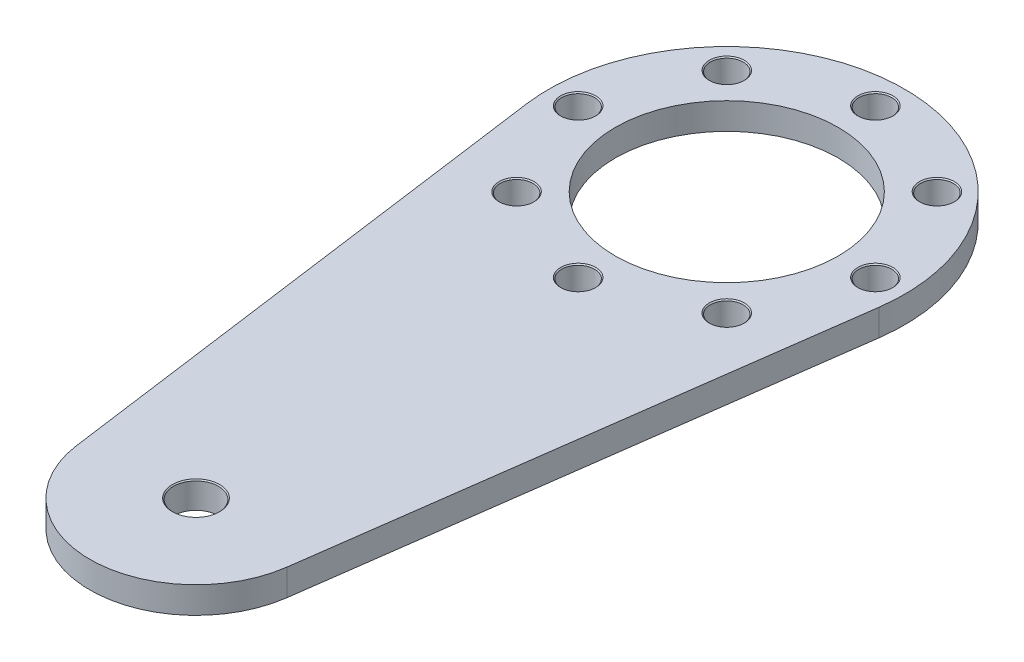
ISO-10303-21;
HEADER;
FILE_DESCRIPTION(('STEP AP214'),'2;1');
FILE_NAME('part.step','',(''),(''),'','','');
FILE_SCHEMA(('AUTOMOTIVE_DESIGN { 1 0 10303 214 1 1 1 1 }'));
ENDSEC;
DATA;
#1=APPLICATION_CONTEXT('core data for automotive mechanical design processes');
#2=APPLICATION_PROTOCOL_DEFINITION('international standard','automotive_design',2000,#1);
#3=PRODUCT_CONTEXT('',#1,'mechanical');
#4=PRODUCT('Part','Part','',(#3));
#5=PRODUCT_RELATED_PRODUCT_CATEGORY('part','',(#4));
#6=PRODUCT_DEFINITION_FORMATION('','',#4);
#7=PRODUCT_DEFINITION_CONTEXT('part definition',#1,'design');
#8=PRODUCT_DEFINITION('design','',#6,#7);
#9=PRODUCT_DEFINITION_SHAPE('','',#8);
#10=(LENGTH_UNIT() NAMED_UNIT(*) SI_UNIT(.MILLI.,.METRE.));
#11=(NAMED_UNIT(*) PLANE_ANGLE_UNIT() SI_UNIT($,.RADIAN.));
#12=(NAMED_UNIT(*) SI_UNIT($,.STERADIAN.) SOLID_ANGLE_UNIT());
#13=UNCERTAINTY_MEASURE_WITH_UNIT(LENGTH_MEASURE(1.E-05),#10,'distance_accuracy_value','');
#14=(GEOMETRIC_REPRESENTATION_CONTEXT(3) GLOBAL_UNCERTAINTY_ASSIGNED_CONTEXT((#13)) GLOBAL_UNIT_ASSIGNED_CONTEXT((#10,
#11,#12)) REPRESENTATION_CONTEXT('',''));
#15=CARTESIAN_POINT('',(0.,0.,0.));
#16=DIRECTION('',(0.,0.,1.));
#17=DIRECTION('',(1.,0.,0.));
#18=AXIS2_PLACEMENT_3D('',#15,#16,#17);
#19=CARTESIAN_POINT('',(0.,5.,0.));
#20=DIRECTION('',(0.,1.,0.));
#21=DIRECTION('',(0.,0.,1.));
#22=AXIS2_PLACEMENT_3D('',#19,#20,#21);
#23=PLANE('',#22);
#24=CARTESIAN_POINT('',(-19.7989898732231,5.,19.7989898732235));
#25=DIRECTION('',(0.,1.,0.));
#26=DIRECTION('',(0.,0.,1.));
#27=AXIS2_PLACEMENT_3D('',#24,#25,#26);
#28=CIRCLE('',#27,3.3);
#29=CARTESIAN_POINT('',(-19.7989898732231,5.,23.0989898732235));
#30=VERTEX_POINT('',#29);
#31=EDGE_CURVE('E515',#30,#30,#28,.T.);
#32=ORIENTED_EDGE('',*,*,#31,.F.);
#33=EDGE_LOOP('',(#32));
#34=FACE_BOUND('',#33,.T.);
#35=CARTESIAN_POINT('',(-28.,5.,2.18677445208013E-13));
#36=DIRECTION('',(0.,1.,0.));
#37=DIRECTION('',(0.,0.,1.));
#38=AXIS2_PLACEMENT_3D('',#35,#36,#37);
#39=CIRCLE('',#38,3.3);
#40=CARTESIAN_POINT('',(-28.,5.,3.30000000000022));
#41=VERTEX_POINT('',#40);
#42=EDGE_CURVE('E185',#41,#41,#39,.T.);
#43=ORIENTED_EDGE('',*,*,#42,.F.);
#44=EDGE_LOOP('',(#43));
#45=FACE_BOUND('',#44,.T.);
#46=CARTESIAN_POINT('',(-19.7989898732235,5.,-19.7989898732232));
#47=DIRECTION('',(0.,1.,0.));
#48=DIRECTION('',(0.,0.,1.));
#49=AXIS2_PLACEMENT_3D('',#46,#47,#48);
#50=CIRCLE('',#49,3.3);
#51=CARTESIAN_POINT('',(-19.7989898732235,5.,-16.4989898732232));
#52=VERTEX_POINT('',#51);
#53=EDGE_CURVE('E175',#52,#52,#50,.T.);
#54=ORIENTED_EDGE('',*,*,#53,.F.);
#55=EDGE_LOOP('',(#54));
#56=FACE_BOUND('',#55,.T.);
#57=CARTESIAN_POINT('',(-1.45784963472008E-13,5.,-28.));
#58=DIRECTION('',(0.,1.,0.));
#59=DIRECTION('',(0.,0.,1.));
#60=AXIS2_PLACEMENT_3D('',#57,#58,#59);
#61=CIRCLE('',#60,3.3);
#62=CARTESIAN_POINT('',(-1.45784963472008E-13,5.,-24.7));
#63=VERTEX_POINT('',#62);
#64=EDGE_CURVE('E170',#63,#63,#61,.T.);
#65=ORIENTED_EDGE('',*,*,#64,.F.);
#66=EDGE_LOOP('',(#65));
#67=FACE_BOUND('',#66,.T.);
#68=CARTESIAN_POINT('',(19.7989898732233,5.,-19.7989898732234));
#69=DIRECTION('',(0.,1.,0.));
#70=DIRECTION('',(0.,0.,1.));
#71=AXIS2_PLACEMENT_3D('',#68,#69,#70);
#72=CIRCLE('',#71,3.3);
#73=CARTESIAN_POINT('',(19.7989898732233,5.,-16.4989898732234));
#74=VERTEX_POINT('',#73);
#75=EDGE_CURVE('E165',#74,#74,#72,.T.);
#76=ORIENTED_EDGE('',*,*,#75,.F.);
#77=EDGE_LOOP('',(#76));
#78=FACE_BOUND('',#77,.T.);
#79=CARTESIAN_POINT('',(28.,5.,0.));
#80=DIRECTION('',(0.,1.,0.));
#81=DIRECTION('',(0.,0.,1.));
#82=AXIS2_PLACEMENT_3D('',#79,#80,#81);
#83=CIRCLE('',#82,3.3);
#84=CARTESIAN_POINT('',(28.,5.,3.29999999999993));
#85=VERTEX_POINT('',#84);
#86=EDGE_CURVE('E159',#85,#85,#83,.T.);
#87=ORIENTED_EDGE('',*,*,#86,.F.);
#88=EDGE_LOOP('',(#87));
#89=FACE_BOUND('',#88,.T.);
#90=CARTESIAN_POINT('',(19.7989898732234,5.,19.7989898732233));
#91=DIRECTION('',(0.,1.,0.));
#92=DIRECTION('',(0.,0.,1.));
#93=AXIS2_PLACEMENT_3D('',#90,#91,#92);
#94=CIRCLE('',#93,3.3);
#95=CARTESIAN_POINT('',(19.7989898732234,5.,23.0989898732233));
#96=VERTEX_POINT('',#95);
#97=EDGE_CURVE('E153',#96,#96,#94,.T.);
#98=ORIENTED_EDGE('',*,*,#97,.F.);
#99=EDGE_LOOP('',(#98));
#100=FACE_BOUND('',#99,.T.);
#101=CARTESIAN_POINT('',(0.,5.,28.));
#102=DIRECTION('',(0.,1.,0.));
#103=DIRECTION('',(0.,0.,1.));
#104=AXIS2_PLACEMENT_3D('',#101,#102,#103);
#105=CIRCLE('',#104,3.3);
#106=CARTESIAN_POINT('',(0.,5.,31.3));
#107=VERTEX_POINT('',#106);
#108=EDGE_CURVE('E147',#107,#107,#105,.T.);
#109=ORIENTED_EDGE('',*,*,#108,.F.);
#110=EDGE_LOOP('',(#109));
#111=FACE_BOUND('',#110,.T.);
#112=CARTESIAN_POINT('',(0.,5.,100.));
#113=DIRECTION('',(0.,1.,0.));
#114=DIRECTION('',(0.,0.,1.));
#115=AXIS2_PLACEMENT_3D('',#112,#113,#114);
#116=CIRCLE('',#115,4.45);
#117=CARTESIAN_POINT('',(0.,5.,104.45));
#118=VERTEX_POINT('',#117);
#119=EDGE_CURVE('E141',#118,#118,#116,.T.);
#120=ORIENTED_EDGE('',*,*,#119,.F.);
#121=EDGE_LOOP('',(#120));
#122=FACE_BOUND('',#121,.T.);
#123=CARTESIAN_POINT('',(0.,5.,0.));
#124=DIRECTION('',(0.,1.,0.));
#125=DIRECTION('',(0.,0.,1.));
#126=AXIS2_PLACEMENT_3D('',#123,#124,#125);
#127=CIRCLE('',#126,33.5);
#128=CARTESIAN_POINT('',(33.1933275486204,5.,4.52249999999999));
#129=VERTEX_POINT('',#128);
#130=CARTESIAN_POINT('',(-33.1933275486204,5.,4.52249999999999));
#131=VERTEX_POINT('',#130);
#132=EDGE_CURVE('E98',#129,#131,#127,.T.);
#133=ORIENTED_EDGE('',*,*,#132,.T.);
#134=DIRECTION('',(0.135,0.,0.99084559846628));
#135=VECTOR('',#134,1.);
#136=CARTESIAN_POINT('',(-33.1933275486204,5.,4.52249999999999));
#137=LINE('',#136,#135);
#138=CARTESIAN_POINT('',(-19.8169119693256,5.,102.7));
#139=VERTEX_POINT('',#138);
#140=EDGE_CURVE('E93',#131,#139,#137,.T.);
#141=ORIENTED_EDGE('',*,*,#140,.T.);
#142=CARTESIAN_POINT('',(0.,5.,100.));
#143=DIRECTION('',(0.,1.,0.));
#144=DIRECTION('',(0.,0.,1.));
#145=AXIS2_PLACEMENT_3D('',#142,#143,#144);
#146=CIRCLE('',#145,20.);
#147=CARTESIAN_POINT('',(19.8169119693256,5.,102.7));
#148=VERTEX_POINT('',#147);
#149=EDGE_CURVE('E96',#139,#148,#146,.T.);
#150=ORIENTED_EDGE('',*,*,#149,.T.);
#151=DIRECTION('',(0.135,0.,-0.99084559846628));
#152=VECTOR('',#151,1.);
#153=CARTESIAN_POINT('',(33.1933275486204,5.,4.52249999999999));
#154=LINE('',#153,#152);
#155=EDGE_CURVE('E63',#148,#129,#154,.T.);
#156=ORIENTED_EDGE('',*,*,#155,.T.);
#157=EDGE_LOOP('',(#133,#141,#150,#156));
#158=FACE_BOUND('',#157,.T.);
#159=CARTESIAN_POINT('',(0.,5.,0.));
#160=DIRECTION('',(0.,1.,0.));
#161=DIRECTION('',(0.,0.,1.));
#162=AXIS2_PLACEMENT_3D('',#159,#160,#161);
#163=CIRCLE('',#162,21.);
#164=CARTESIAN_POINT('',(0.,5.,21.));
#165=VERTEX_POINT('',#164);
#166=EDGE_CURVE('E120',#165,#165,#163,.T.);
#167=ORIENTED_EDGE('',*,*,#166,.F.);
#168=EDGE_LOOP('',(#167));
#169=FACE_BOUND('',#168,.T.);
#170=ADVANCED_FACE('F43',(#34,#45,#56,#67,#78,#89,#100,#111,#122,#158,#169),#23,.T.);
#171=CARTESIAN_POINT('',(0.,0.,0.));
#172=DIRECTION('',(0.,1.,0.));
#173=DIRECTION('',(0.,0.,1.));
#174=AXIS2_PLACEMENT_3D('',#171,#172,#173);
#175=PLANE('',#174);
#176=CARTESIAN_POINT('',(-19.7989898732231,0.,19.7989898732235));
#177=DIRECTION('',(0.,1.,0.));
#178=DIRECTION('',(0.,0.,1.));
#179=AXIS2_PLACEMENT_3D('',#176,#177,#178);
#180=CIRCLE('',#179,3.1);
#181=CARTESIAN_POINT('',(-19.7989898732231,0.,22.8989898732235));
#182=VERTEX_POINT('',#181);
#183=EDGE_CURVE('E47',#182,#182,#180,.T.);
#184=ORIENTED_EDGE('',*,*,#183,.T.);
#185=EDGE_LOOP('',(#184));
#186=FACE_BOUND('',#185,.T.);
#187=CARTESIAN_POINT('',(-28.,0.,2.18677445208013E-13));
#188=DIRECTION('',(0.,1.,0.));
#189=DIRECTION('',(0.,0.,1.));
#190=AXIS2_PLACEMENT_3D('',#187,#188,#189);
#191=CIRCLE('',#190,3.1);
#192=CARTESIAN_POINT('',(-28.,0.,3.10000000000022));
#193=VERTEX_POINT('',#192);
#194=EDGE_CURVE('E172',#193,#193,#191,.T.);
#195=ORIENTED_EDGE('',*,*,#194,.T.);
#196=EDGE_LOOP('',(#195));
#197=FACE_BOUND('',#196,.T.);
#198=CARTESIAN_POINT('',(-19.7989898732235,0.,-19.7989898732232));
#199=DIRECTION('',(0.,1.,0.));
#200=DIRECTION('',(0.,0.,1.));
#201=AXIS2_PLACEMENT_3D('',#198,#199,#200);
#202=CIRCLE('',#201,3.1);
#203=CARTESIAN_POINT('',(-19.7989898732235,0.,-16.6989898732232));
#204=VERTEX_POINT('',#203);
#205=EDGE_CURVE('E167',#204,#204,#202,.T.);
#206=ORIENTED_EDGE('',*,*,#205,.T.);
#207=EDGE_LOOP('',(#206));
#208=FACE_BOUND('',#207,.T.);
#209=CARTESIAN_POINT('',(-1.45784963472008E-13,0.,-28.));
#210=DIRECTION('',(0.,1.,0.));
#211=DIRECTION('',(0.,0.,1.));
#212=AXIS2_PLACEMENT_3D('',#209,#210,#211);
#213=CIRCLE('',#212,3.1);
#214=CARTESIAN_POINT('',(-1.45784963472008E-13,0.,-24.9));
#215=VERTEX_POINT('',#214);
#216=EDGE_CURVE('E161',#215,#215,#213,.T.);
#217=ORIENTED_EDGE('',*,*,#216,.T.);
#218=EDGE_LOOP('',(#217));
#219=FACE_BOUND('',#218,.T.);
#220=CARTESIAN_POINT('',(19.7989898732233,0.,-19.7989898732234));
#221=DIRECTION('',(0.,1.,0.));
#222=DIRECTION('',(0.,0.,1.));
#223=AXIS2_PLACEMENT_3D('',#220,#221,#222);
#224=CIRCLE('',#223,3.1);
#225=CARTESIAN_POINT('',(19.7989898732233,0.,-16.6989898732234));
#226=VERTEX_POINT('',#225);
#227=EDGE_CURVE('E155',#226,#226,#224,.T.);
#228=ORIENTED_EDGE('',*,*,#227,.T.);
#229=EDGE_LOOP('',(#228));
#230=FACE_BOUND('',#229,.T.);
#231=CARTESIAN_POINT('',(28.,0.,0.));
#232=DIRECTION('',(0.,1.,0.));
#233=DIRECTION('',(0.,0.,1.));
#234=AXIS2_PLACEMENT_3D('',#231,#232,#233);
#235=CIRCLE('',#234,3.1);
#236=CARTESIAN_POINT('',(28.,0.,3.09999999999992));
#237=VERTEX_POINT('',#236);
#238=EDGE_CURVE('E149',#237,#237,#235,.T.);
#239=ORIENTED_EDGE('',*,*,#238,.T.);
#240=EDGE_LOOP('',(#239));
#241=FACE_BOUND('',#240,.T.);
#242=CARTESIAN_POINT('',(19.7989898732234,0.,19.7989898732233));
#243=DIRECTION('',(0.,1.,0.));
#244=DIRECTION('',(0.,0.,1.));
#245=AXIS2_PLACEMENT_3D('',#242,#243,#244);
#246=CIRCLE('',#245,3.1);
#247=CARTESIAN_POINT('',(19.7989898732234,0.,22.8989898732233));
#248=VERTEX_POINT('',#247);
#249=EDGE_CURVE('E143',#248,#248,#246,.T.);
#250=ORIENTED_EDGE('',*,*,#249,.T.);
#251=EDGE_LOOP('',(#250));
#252=FACE_BOUND('',#251,.T.);
#253=CARTESIAN_POINT('',(0.,0.,28.));
#254=DIRECTION('',(0.,1.,0.));
#255=DIRECTION('',(0.,0.,1.));
#256=AXIS2_PLACEMENT_3D('',#253,#254,#255);
#257=CIRCLE('',#256,3.1);
#258=CARTESIAN_POINT('',(0.,0.,31.1));
#259=VERTEX_POINT('',#258);
#260=EDGE_CURVE('E137',#259,#259,#257,.T.);
#261=ORIENTED_EDGE('',*,*,#260,.T.);
#262=EDGE_LOOP('',(#261));
#263=FACE_BOUND('',#262,.T.);
#264=CARTESIAN_POINT('',(0.,0.,100.));
#265=DIRECTION('',(0.,1.,0.));
#266=DIRECTION('',(0.,0.,1.));
#267=AXIS2_PLACEMENT_3D('',#264,#265,#266);
#268=CIRCLE('',#267,4.25);
#269=CARTESIAN_POINT('',(0.,0.,104.25));
#270=VERTEX_POINT('',#269);
#271=EDGE_CURVE('E131',#270,#270,#268,.T.);
#272=ORIENTED_EDGE('',*,*,#271,.T.);
#273=EDGE_LOOP('',(#272));
#274=FACE_BOUND('',#273,.T.);
#275=CARTESIAN_POINT('',(0.,0.,0.));
#276=DIRECTION('',(0.,1.,0.));
#277=DIRECTION('',(0.,0.,1.));
#278=AXIS2_PLACEMENT_3D('',#275,#276,#277);
#279=CIRCLE('',#278,33.5);
#280=CARTESIAN_POINT('',(33.1933275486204,0.,4.52249999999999));
#281=VERTEX_POINT('',#280);
#282=CARTESIAN_POINT('',(-33.1933275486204,0.,4.52249999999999));
#283=VERTEX_POINT('',#282);
#284=EDGE_CURVE('E116',#281,#283,#279,.T.);
#285=ORIENTED_EDGE('',*,*,#284,.F.);
#286=DIRECTION('',(0.135,0.,-0.99084559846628));
#287=VECTOR('',#286,1.);
#288=CARTESIAN_POINT('',(33.1933275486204,0.,4.52249999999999));
#289=LINE('',#288,#287);
#290=CARTESIAN_POINT('',(19.8169119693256,0.,102.7));
#291=VERTEX_POINT('',#290);
#292=EDGE_CURVE('E86',#291,#281,#289,.T.);
#293=ORIENTED_EDGE('',*,*,#292,.F.);
#294=CARTESIAN_POINT('',(0.,0.,100.));
#295=DIRECTION('',(0.,1.,0.));
#296=DIRECTION('',(0.,0.,1.));
#297=AXIS2_PLACEMENT_3D('',#294,#295,#296);
#298=CIRCLE('',#297,20.);
#299=CARTESIAN_POINT('',(-19.8169119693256,0.,102.7));
#300=VERTEX_POINT('',#299);
#301=EDGE_CURVE('E80',#300,#291,#298,.T.);
#302=ORIENTED_EDGE('',*,*,#301,.F.);
#303=DIRECTION('',(0.135,0.,0.99084559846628));
#304=VECTOR('',#303,1.);
#305=CARTESIAN_POINT('',(-33.1933275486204,0.,4.52249999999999));
#306=LINE('',#305,#304);
#307=EDGE_CURVE('E103',#283,#300,#306,.T.);
#308=ORIENTED_EDGE('',*,*,#307,.F.);
#309=EDGE_LOOP('',(#285,#293,#302,#308));
#310=FACE_BOUND('',#309,.T.);
#311=CARTESIAN_POINT('',(0.,0.,0.));
#312=DIRECTION('',(0.,1.,0.));
#313=DIRECTION('',(0.,0.,1.));
#314=AXIS2_PLACEMENT_3D('',#311,#312,#313);
#315=CIRCLE('',#314,21.);
#316=CARTESIAN_POINT('',(0.,0.,21.));
#317=VERTEX_POINT('',#316);
#318=EDGE_CURVE('E135',#317,#317,#315,.T.);
#319=ORIENTED_EDGE('',*,*,#318,.T.);
#320=EDGE_LOOP('',(#319));
#321=FACE_BOUND('',#320,.T.);
#322=ADVANCED_FACE('F271',(#186,#197,#208,#219,#230,#241,#252,#263,#274,#310,#321),#175,.F.);
#323=CARTESIAN_POINT('',(0.,5.,0.));
#324=DIRECTION('',(0.,-1.,0.));
#325=DIRECTION('',(0.,0.,-1.));
#326=AXIS2_PLACEMENT_3D('',#323,#324,#325);
#327=CYLINDRICAL_SURFACE('',#326,33.5);
#328=ORIENTED_EDGE('',*,*,#284,.T.);
#329=DIRECTION('',(0.,-1.,0.));
#330=VECTOR('',#329,1.);
#331=CARTESIAN_POINT('',(-33.1933275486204,5.,4.52249999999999));
#332=LINE('',#331,#330);
#333=EDGE_CURVE('E11',#131,#283,#332,.T.);
#334=ORIENTED_EDGE('',*,*,#333,.F.);
#335=ORIENTED_EDGE('',*,*,#132,.F.);
#336=DIRECTION('',(0.,-1.,0.));
#337=VECTOR('',#336,1.);
#338=CARTESIAN_POINT('',(33.1933275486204,5.,4.52249999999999));
#339=LINE('',#338,#337);
#340=EDGE_CURVE('E112',#129,#281,#339,.T.);
#341=ORIENTED_EDGE('',*,*,#340,.T.);
#342=EDGE_LOOP('',(#328,#334,#335,#341));
#343=FACE_BOUND('',#342,.T.);
#344=ADVANCED_FACE('F45',(#343),#327,.T.);
#345=CARTESIAN_POINT('',(-33.1933275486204,5.,4.52249999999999));
#346=DIRECTION('',(0.99084559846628,0.,-0.135));
#347=DIRECTION('',(-0.135,0.,-0.99084559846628));
#348=AXIS2_PLACEMENT_3D('',#345,#346,#347);
#349=PLANE('',#348);
#350=ORIENTED_EDGE('',*,*,#307,.T.);
#351=DIRECTION('',(0.,-1.,0.));
#352=VECTOR('',#351,1.);
#353=CARTESIAN_POINT('',(-19.8169119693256,5.,102.7));
#354=LINE('',#353,#352);
#355=EDGE_CURVE('E54',#139,#300,#354,.T.);
#356=ORIENTED_EDGE('',*,*,#355,.F.);
#357=ORIENTED_EDGE('',*,*,#140,.F.);
#358=ORIENTED_EDGE('',*,*,#333,.T.);
#359=EDGE_LOOP('',(#350,#356,#357,#358));
#360=FACE_BOUND('',#359,.T.);
#361=ADVANCED_FACE('F102',(#360),#349,.F.);
#362=CARTESIAN_POINT('',(0.,5.,100.));
#363=DIRECTION('',(0.,-1.,0.));
#364=DIRECTION('',(0.,0.,-1.));
#365=AXIS2_PLACEMENT_3D('',#362,#363,#364);
#366=CYLINDRICAL_SURFACE('',#365,20.);
#367=ORIENTED_EDGE('',*,*,#301,.T.);
#368=DIRECTION('',(0.,-1.,0.));
#369=VECTOR('',#368,1.);
#370=CARTESIAN_POINT('',(19.8169119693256,5.,102.7));
#371=LINE('',#370,#369);
#372=EDGE_CURVE('E105',#148,#291,#371,.T.);
#373=ORIENTED_EDGE('',*,*,#372,.F.);
#374=ORIENTED_EDGE('',*,*,#149,.F.);
#375=ORIENTED_EDGE('',*,*,#355,.T.);
#376=EDGE_LOOP('',(#367,#373,#374,#375));
#377=FACE_BOUND('',#376,.T.);
#378=ADVANCED_FACE('F107',(#377),#366,.T.);
#379=CARTESIAN_POINT('',(33.1933275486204,5.,4.52249999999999));
#380=DIRECTION('',(-0.99084559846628,0.,-0.135));
#381=DIRECTION('',(-0.135,0.,0.99084559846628));
#382=AXIS2_PLACEMENT_3D('',#379,#380,#381);
#383=PLANE('',#382);
#384=ORIENTED_EDGE('',*,*,#292,.T.);
#385=ORIENTED_EDGE('',*,*,#340,.F.);
#386=ORIENTED_EDGE('',*,*,#155,.F.);
#387=ORIENTED_EDGE('',*,*,#372,.T.);
#388=EDGE_LOOP('',(#384,#385,#386,#387));
#389=FACE_BOUND('',#388,.T.);
#390=ADVANCED_FACE('F276',(#389),#383,.F.);
#391=CARTESIAN_POINT('',(0.,5.,0.));
#392=DIRECTION('',(0.,-1.,0.));
#393=DIRECTION('',(0.,0.,-1.));
#394=AXIS2_PLACEMENT_3D('',#391,#392,#393);
#395=CYLINDRICAL_SURFACE('',#394,21.);
#396=ORIENTED_EDGE('',*,*,#166,.T.);
#397=EDGE_LOOP('',(#396));
#398=FACE_BOUND('',#397,.T.);
#399=ORIENTED_EDGE('',*,*,#318,.F.);
#400=EDGE_LOOP('',(#399));
#401=FACE_BOUND('',#400,.T.);
#402=ADVANCED_FACE('F273',(#398,#401),#395,.F.);
#403=CARTESIAN_POINT('',(0.,5.,100.));
#404=DIRECTION('',(0.,1.,0.));
#405=DIRECTION('',(0.,0.,1.));
#406=AXIS2_PLACEMENT_3D('',#403,#404,#405);
#407=CYLINDRICAL_SURFACE('',#406,4.25);
#408=CARTESIAN_POINT('',(0.,4.79999999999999,100.));
#409=DIRECTION('',(0.,1.,0.));
#410=DIRECTION('',(0.,0.,1.));
#411=AXIS2_PLACEMENT_3D('',#408,#409,#410);
#412=CIRCLE('',#411,4.25);
#413=CARTESIAN_POINT('',(0.,4.79999999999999,104.25));
#414=VERTEX_POINT('',#413);
#415=EDGE_CURVE('E136',#414,#414,#412,.T.);
#416=ORIENTED_EDGE('',*,*,#415,.T.);
#417=EDGE_LOOP('',(#416));
#418=FACE_BOUND('',#417,.T.);
#419=ORIENTED_EDGE('',*,*,#271,.F.);
#420=EDGE_LOOP('',(#419));
#421=FACE_BOUND('',#420,.T.);
#422=ADVANCED_FACE('F275',(#418,#421),#407,.F.);
#423=CARTESIAN_POINT('',(0.,5.,100.));
#424=DIRECTION('',(0.,1.,0.));
#425=DIRECTION('',(0.,0.,1.));
#426=AXIS2_PLACEMENT_3D('',#423,#424,#425);
#427=CONICAL_SURFACE('',#426,4.45,0.78539816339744);
#428=ORIENTED_EDGE('',*,*,#415,.F.);
#429=EDGE_LOOP('',(#428));
#430=FACE_BOUND('',#429,.T.);
#431=ORIENTED_EDGE('',*,*,#119,.T.);
#432=EDGE_LOOP('',(#431));
#433=FACE_BOUND('',#432,.T.);
#434=ADVANCED_FACE('F283',(#430,#433),#427,.F.);
#435=CARTESIAN_POINT('',(0.,5.,28.));
#436=DIRECTION('',(0.,1.,0.));
#437=DIRECTION('',(0.,0.,1.));
#438=AXIS2_PLACEMENT_3D('',#435,#436,#437);
#439=CYLINDRICAL_SURFACE('',#438,3.1);
#440=CARTESIAN_POINT('',(0.,4.79999999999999,28.));
#441=DIRECTION('',(0.,1.,0.));
#442=DIRECTION('',(0.,0.,1.));
#443=AXIS2_PLACEMENT_3D('',#440,#441,#442);
#444=CIRCLE('',#443,3.1);
#445=CARTESIAN_POINT('',(0.,4.79999999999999,31.1));
#446=VERTEX_POINT('',#445);
#447=EDGE_CURVE('E142',#446,#446,#444,.T.);
#448=ORIENTED_EDGE('',*,*,#447,.T.);
#449=EDGE_LOOP('',(#448));
#450=FACE_BOUND('',#449,.T.);
#451=ORIENTED_EDGE('',*,*,#260,.F.);
#452=EDGE_LOOP('',(#451));
#453=FACE_BOUND('',#452,.T.);
#454=ADVANCED_FACE('F349',(#450,#453),#439,.F.);
#455=CARTESIAN_POINT('',(0.,5.,28.));
#456=DIRECTION('',(0.,1.,0.));
#457=DIRECTION('',(0.,0.,1.));
#458=AXIS2_PLACEMENT_3D('',#455,#456,#457);
#459=CONICAL_SURFACE('',#458,3.3,0.785398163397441);
#460=ORIENTED_EDGE('',*,*,#447,.F.);
#461=EDGE_LOOP('',(#460));
#462=FACE_BOUND('',#461,.T.);
#463=ORIENTED_EDGE('',*,*,#108,.T.);
#464=EDGE_LOOP('',(#463));
#465=FACE_BOUND('',#464,.T.);
#466=ADVANCED_FACE('F359',(#462,#465),#459,.F.);
#467=CARTESIAN_POINT('',(19.7989898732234,5.,19.7989898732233));
#468=DIRECTION('',(0.,1.,0.));
#469=DIRECTION('',(0.,0.,1.));
#470=AXIS2_PLACEMENT_3D('',#467,#468,#469);
#471=CYLINDRICAL_SURFACE('',#470,3.1);
#472=CARTESIAN_POINT('',(19.7989898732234,4.79999999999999,19.7989898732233));
#473=DIRECTION('',(0.,1.,0.));
#474=DIRECTION('',(0.,0.,1.));
#475=AXIS2_PLACEMENT_3D('',#472,#473,#474);
#476=CIRCLE('',#475,3.1);
#477=CARTESIAN_POINT('',(19.7989898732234,4.79999999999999,22.8989898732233));
#478=VERTEX_POINT('',#477);
#479=EDGE_CURVE('E148',#478,#478,#476,.T.);
#480=ORIENTED_EDGE('',*,*,#479,.T.);
#481=EDGE_LOOP('',(#480));
#482=FACE_BOUND('',#481,.T.);
#483=ORIENTED_EDGE('',*,*,#249,.F.);
#484=EDGE_LOOP('',(#483));
#485=FACE_BOUND('',#484,.T.);
#486=ADVANCED_FACE('F368',(#482,#485),#471,.F.);
#487=CARTESIAN_POINT('',(19.7989898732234,5.,19.7989898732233));
#488=DIRECTION('',(0.,1.,0.));
#489=DIRECTION('',(0.,0.,1.));
#490=AXIS2_PLACEMENT_3D('',#487,#488,#489);
#491=CONICAL_SURFACE('',#490,3.3,0.78539816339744);
#492=ORIENTED_EDGE('',*,*,#479,.F.);
#493=EDGE_LOOP('',(#492));
#494=FACE_BOUND('',#493,.T.);
#495=ORIENTED_EDGE('',*,*,#97,.T.);
#496=EDGE_LOOP('',(#495));
#497=FACE_BOUND('',#496,.T.);
#498=ADVANCED_FACE('F378',(#494,#497),#491,.F.);
#499=CARTESIAN_POINT('',(28.,5.,0.));
#500=DIRECTION('',(0.,1.,0.));
#501=DIRECTION('',(0.,0.,1.));
#502=AXIS2_PLACEMENT_3D('',#499,#500,#501);
#503=CYLINDRICAL_SURFACE('',#502,3.1);
#504=CARTESIAN_POINT('',(28.,4.79999999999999,0.));
#505=DIRECTION('',(0.,1.,0.));
#506=DIRECTION('',(0.,0.,1.));
#507=AXIS2_PLACEMENT_3D('',#504,#505,#506);
#508=CIRCLE('',#507,3.1);
#509=CARTESIAN_POINT('',(28.,4.79999999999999,3.09999999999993));
#510=VERTEX_POINT('',#509);
#511=EDGE_CURVE('E154',#510,#510,#508,.T.);
#512=ORIENTED_EDGE('',*,*,#511,.T.);
#513=EDGE_LOOP('',(#512));
#514=FACE_BOUND('',#513,.T.);
#515=ORIENTED_EDGE('',*,*,#238,.F.);
#516=EDGE_LOOP('',(#515));
#517=FACE_BOUND('',#516,.T.);
#518=ADVANCED_FACE('F388',(#514,#517),#503,.F.);
#519=CARTESIAN_POINT('',(28.,5.,0.));
#520=DIRECTION('',(0.,1.,0.));
#521=DIRECTION('',(0.,0.,1.));
#522=AXIS2_PLACEMENT_3D('',#519,#520,#521);
#523=CONICAL_SURFACE('',#522,3.3,0.78539816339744);
#524=ORIENTED_EDGE('',*,*,#511,.F.);
#525=EDGE_LOOP('',(#524));
#526=FACE_BOUND('',#525,.T.);
#527=ORIENTED_EDGE('',*,*,#86,.T.);
#528=EDGE_LOOP('',(#527));
#529=FACE_BOUND('',#528,.T.);
#530=ADVANCED_FACE('F398',(#526,#529),#523,.F.);
#531=CARTESIAN_POINT('',(19.7989898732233,5.,-19.7989898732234));
#532=DIRECTION('',(0.,1.,0.));
#533=DIRECTION('',(0.,0.,1.));
#534=AXIS2_PLACEMENT_3D('',#531,#532,#533);
#535=CYLINDRICAL_SURFACE('',#534,3.1);
#536=CARTESIAN_POINT('',(19.7989898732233,4.79999999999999,-19.7989898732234));
#537=DIRECTION('',(0.,1.,0.));
#538=DIRECTION('',(0.,0.,1.));
#539=AXIS2_PLACEMENT_3D('',#536,#537,#538);
#540=CIRCLE('',#539,3.1);
#541=CARTESIAN_POINT('',(19.7989898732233,4.79999999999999,-16.6989898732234));
#542=VERTEX_POINT('',#541);
#543=EDGE_CURVE('E160',#542,#542,#540,.T.);
#544=ORIENTED_EDGE('',*,*,#543,.T.);
#545=EDGE_LOOP('',(#544));
#546=FACE_BOUND('',#545,.T.);
#547=ORIENTED_EDGE('',*,*,#227,.F.);
#548=EDGE_LOOP('',(#547));
#549=FACE_BOUND('',#548,.T.);
#550=ADVANCED_FACE('F408',(#546,#549),#535,.F.);
#551=CARTESIAN_POINT('',(19.7989898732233,5.,-19.7989898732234));
#552=DIRECTION('',(0.,1.,0.));
#553=DIRECTION('',(0.,0.,1.));
#554=AXIS2_PLACEMENT_3D('',#551,#552,#553);
#555=CONICAL_SURFACE('',#554,3.3,0.78539816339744);
#556=ORIENTED_EDGE('',*,*,#543,.F.);
#557=EDGE_LOOP('',(#556));
#558=FACE_BOUND('',#557,.T.);
#559=ORIENTED_EDGE('',*,*,#75,.T.);
#560=EDGE_LOOP('',(#559));
#561=FACE_BOUND('',#560,.T.);
#562=ADVANCED_FACE('F418',(#558,#561),#555,.F.);
#563=CARTESIAN_POINT('',(-1.45784963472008E-13,5.,-28.));
#564=DIRECTION('',(0.,1.,0.));
#565=DIRECTION('',(0.,0.,1.));
#566=AXIS2_PLACEMENT_3D('',#563,#564,#565);
#567=CYLINDRICAL_SURFACE('',#566,3.1);
#568=CARTESIAN_POINT('',(-1.45784963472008E-13,4.79999999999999,-28.));
#569=DIRECTION('',(0.,1.,0.));
#570=DIRECTION('',(0.,0.,1.));
#571=AXIS2_PLACEMENT_3D('',#568,#569,#570);
#572=CIRCLE('',#571,3.1);
#573=CARTESIAN_POINT('',(-1.45784963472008E-13,4.79999999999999,-24.9));
#574=VERTEX_POINT('',#573);
#575=EDGE_CURVE('E166',#574,#574,#572,.T.);
#576=ORIENTED_EDGE('',*,*,#575,.T.);
#577=EDGE_LOOP('',(#576));
#578=FACE_BOUND('',#577,.T.);
#579=ORIENTED_EDGE('',*,*,#216,.F.);
#580=EDGE_LOOP('',(#579));
#581=FACE_BOUND('',#580,.T.);
#582=ADVANCED_FACE('F428',(#578,#581),#567,.F.);
#583=CARTESIAN_POINT('',(-1.45784963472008E-13,5.,-28.));
#584=DIRECTION('',(0.,1.,0.));
#585=DIRECTION('',(0.,0.,1.));
#586=AXIS2_PLACEMENT_3D('',#583,#584,#585);
#587=CONICAL_SURFACE('',#586,3.3,0.785398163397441);
#588=ORIENTED_EDGE('',*,*,#575,.F.);
#589=EDGE_LOOP('',(#588));
#590=FACE_BOUND('',#589,.T.);
#591=ORIENTED_EDGE('',*,*,#64,.T.);
#592=EDGE_LOOP('',(#591));
#593=FACE_BOUND('',#592,.T.);
#594=ADVANCED_FACE('F438',(#590,#593),#587,.F.);
#595=CARTESIAN_POINT('',(-19.7989898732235,5.,-19.7989898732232));
#596=DIRECTION('',(0.,1.,0.));
#597=DIRECTION('',(0.,0.,1.));
#598=AXIS2_PLACEMENT_3D('',#595,#596,#597);
#599=CYLINDRICAL_SURFACE('',#598,3.1);
#600=CARTESIAN_POINT('',(-19.7989898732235,4.79999999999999,-19.7989898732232));
#601=DIRECTION('',(0.,1.,0.));
#602=DIRECTION('',(0.,0.,1.));
#603=AXIS2_PLACEMENT_3D('',#600,#601,#602);
#604=CIRCLE('',#603,3.1);
#605=CARTESIAN_POINT('',(-19.7989898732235,4.79999999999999,-16.6989898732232));
#606=VERTEX_POINT('',#605);
#607=EDGE_CURVE('E171',#606,#606,#604,.T.);
#608=ORIENTED_EDGE('',*,*,#607,.T.);
#609=EDGE_LOOP('',(#608));
#610=FACE_BOUND('',#609,.T.);
#611=ORIENTED_EDGE('',*,*,#205,.F.);
#612=EDGE_LOOP('',(#611));
#613=FACE_BOUND('',#612,.T.);
#614=ADVANCED_FACE('F448',(#610,#613),#599,.F.);
#615=CARTESIAN_POINT('',(-19.7989898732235,5.,-19.7989898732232));
#616=DIRECTION('',(0.,1.,0.));
#617=DIRECTION('',(0.,0.,1.));
#618=AXIS2_PLACEMENT_3D('',#615,#616,#617);
#619=CONICAL_SURFACE('',#618,3.3,0.78539816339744);
#620=ORIENTED_EDGE('',*,*,#607,.F.);
#621=EDGE_LOOP('',(#620));
#622=FACE_BOUND('',#621,.T.);
#623=ORIENTED_EDGE('',*,*,#53,.T.);
#624=EDGE_LOOP('',(#623));
#625=FACE_BOUND('',#624,.T.);
#626=ADVANCED_FACE('F458',(#622,#625),#619,.F.);
#627=CARTESIAN_POINT('',(-28.,5.,2.18677445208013E-13));
#628=DIRECTION('',(0.,1.,0.));
#629=DIRECTION('',(0.,0.,1.));
#630=AXIS2_PLACEMENT_3D('',#627,#628,#629);
#631=CYLINDRICAL_SURFACE('',#630,3.1);
#632=CARTESIAN_POINT('',(-28.,4.79999999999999,2.18677445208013E-13));
#633=DIRECTION('',(0.,1.,0.));
#634=DIRECTION('',(0.,0.,1.));
#635=AXIS2_PLACEMENT_3D('',#632,#633,#634);
#636=CIRCLE('',#635,3.1);
#637=CARTESIAN_POINT('',(-28.,4.79999999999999,3.10000000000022));
#638=VERTEX_POINT('',#637);
#639=EDGE_CURVE('E176',#638,#638,#636,.T.);
#640=ORIENTED_EDGE('',*,*,#639,.T.);
#641=EDGE_LOOP('',(#640));
#642=FACE_BOUND('',#641,.T.);
#643=ORIENTED_EDGE('',*,*,#194,.F.);
#644=EDGE_LOOP('',(#643));
#645=FACE_BOUND('',#644,.T.);
#646=ADVANCED_FACE('F468',(#642,#645),#631,.F.);
#647=CARTESIAN_POINT('',(-28.,5.,2.18677445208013E-13));
#648=DIRECTION('',(0.,1.,0.));
#649=DIRECTION('',(0.,0.,1.));
#650=AXIS2_PLACEMENT_3D('',#647,#648,#649);
#651=CONICAL_SURFACE('',#650,3.3,0.78539816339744);
#652=ORIENTED_EDGE('',*,*,#639,.F.);
#653=EDGE_LOOP('',(#652));
#654=FACE_BOUND('',#653,.T.);
#655=ORIENTED_EDGE('',*,*,#42,.T.);
#656=EDGE_LOOP('',(#655));
#657=FACE_BOUND('',#656,.T.);
#658=ADVANCED_FACE('F478',(#654,#657),#651,.F.);
#659=CARTESIAN_POINT('',(-19.7989898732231,5.,19.7989898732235));
#660=DIRECTION('',(0.,1.,0.));
#661=DIRECTION('',(0.,0.,1.));
#662=AXIS2_PLACEMENT_3D('',#659,#660,#661);
#663=CYLINDRICAL_SURFACE('',#662,3.1);
#664=CARTESIAN_POINT('',(-19.7989898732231,4.79999999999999,19.7989898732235));
#665=DIRECTION('',(0.,1.,0.));
#666=DIRECTION('',(0.,0.,1.));
#667=AXIS2_PLACEMENT_3D('',#664,#665,#666);
#668=CIRCLE('',#667,3.1);
#669=CARTESIAN_POINT('',(-19.7989898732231,4.79999999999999,22.8989898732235));
#670=VERTEX_POINT('',#669);
#671=EDGE_CURVE('E513',#670,#670,#668,.T.);
#672=ORIENTED_EDGE('',*,*,#671,.T.);
#673=EDGE_LOOP('',(#672));
#674=FACE_BOUND('',#673,.T.);
#675=ORIENTED_EDGE('',*,*,#183,.F.);
#676=EDGE_LOOP('',(#675));
#677=FACE_BOUND('',#676,.T.);
#678=ADVANCED_FACE('F487',(#674,#677),#663,.F.);
#679=CARTESIAN_POINT('',(-19.7989898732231,5.,19.7989898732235));
#680=DIRECTION('',(0.,1.,0.));
#681=DIRECTION('',(0.,0.,1.));
#682=AXIS2_PLACEMENT_3D('',#679,#680,#681);
#683=CONICAL_SURFACE('',#682,3.3,0.78539816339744);
#684=ORIENTED_EDGE('',*,*,#671,.F.);
#685=EDGE_LOOP('',(#684));
#686=FACE_BOUND('',#685,.T.);
#687=ORIENTED_EDGE('',*,*,#31,.T.);
#688=EDGE_LOOP('',(#687));
#689=FACE_BOUND('',#688,.T.);
#690=ADVANCED_FACE('F497',(#686,#689),#683,.F.);
#691=CLOSED_SHELL('',(#170,#322,#344,#361,#378,#390,#402,#422,#434,#454,#466,#486,#498,#518,
#530,#550,#562,#582,#594,#614,#626,#646,#658,#678,#690));
#692=MANIFOLD_SOLID_BREP('B2',#691);
#693=ADVANCED_BREP_SHAPE_REPRESENTATION('',(#18,#692),#14);
#694=SHAPE_DEFINITION_REPRESENTATION(#9,#693);
ENDSEC;
END-ISO-10303-21;
